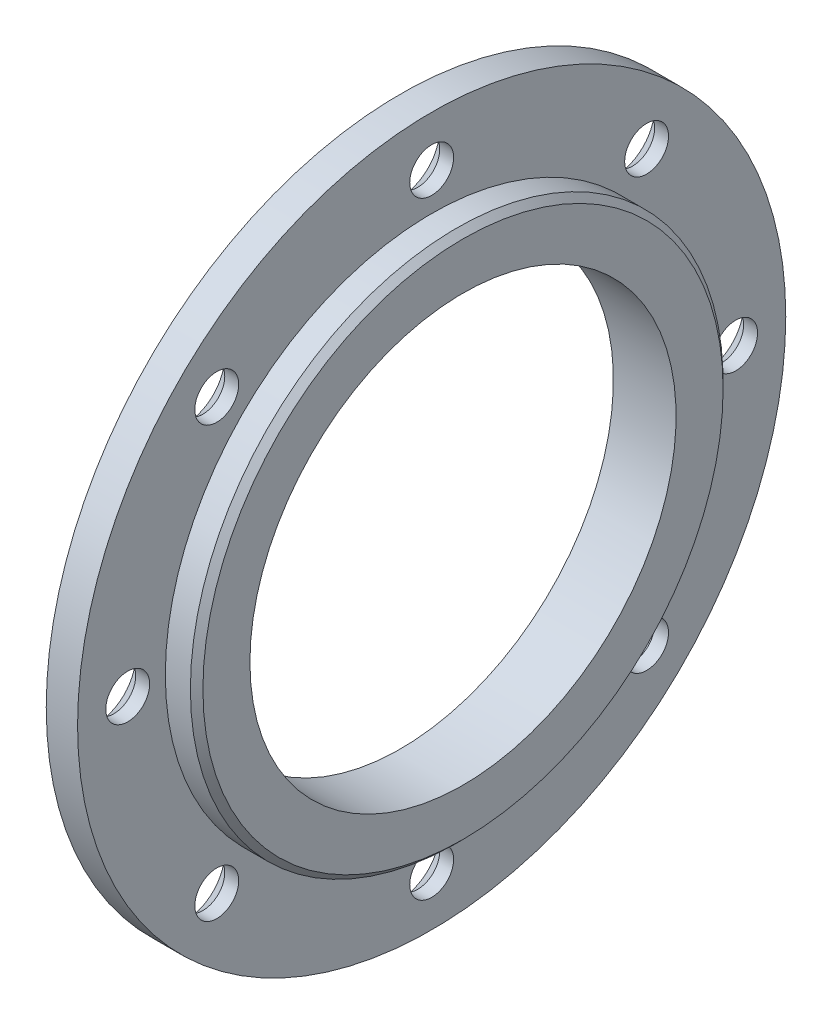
ISO-10303-21;
HEADER;
FILE_DESCRIPTION(('STEP AP214'),'2;1');
FILE_NAME('part.step','',(''),(''),'','','');
FILE_SCHEMA(('AUTOMOTIVE_DESIGN { 1 0 10303 214 1 1 1 1 }'));
ENDSEC;
DATA;
#1=APPLICATION_CONTEXT('core data for automotive mechanical design processes');
#2=APPLICATION_PROTOCOL_DEFINITION('international standard','automotive_design',2000,#1);
#3=PRODUCT_CONTEXT('',#1,'mechanical');
#4=PRODUCT('Part','Part','',(#3));
#5=PRODUCT_RELATED_PRODUCT_CATEGORY('part','',(#4));
#6=PRODUCT_DEFINITION_FORMATION('','',#4);
#7=PRODUCT_DEFINITION_CONTEXT('part definition',#1,'design');
#8=PRODUCT_DEFINITION('design','',#6,#7);
#9=PRODUCT_DEFINITION_SHAPE('','',#8);
#10=(LENGTH_UNIT() NAMED_UNIT(*) SI_UNIT(.MILLI.,.METRE.));
#11=(NAMED_UNIT(*) PLANE_ANGLE_UNIT() SI_UNIT($,.RADIAN.));
#12=(NAMED_UNIT(*) SI_UNIT($,.STERADIAN.) SOLID_ANGLE_UNIT());
#13=UNCERTAINTY_MEASURE_WITH_UNIT(LENGTH_MEASURE(1.E-05),#10,'distance_accuracy_value','');
#14=(GEOMETRIC_REPRESENTATION_CONTEXT(3) GLOBAL_UNCERTAINTY_ASSIGNED_CONTEXT((#13)) GLOBAL_UNIT_ASSIGNED_CONTEXT((#10,
#11,#12)) REPRESENTATION_CONTEXT('',''));
#15=CARTESIAN_POINT('',(0.,0.,0.));
#16=DIRECTION('',(0.,0.,1.));
#17=DIRECTION('',(1.,0.,0.));
#18=AXIS2_PLACEMENT_3D('',#15,#16,#17);
#19=CARTESIAN_POINT('',(0.,34.,0.));
#20=DIRECTION('',(1.,0.,0.));
#21=DIRECTION('',(0.,0.,-1.));
#22=AXIS2_PLACEMENT_3D('',#19,#20,#21);
#23=PLANE('',#22);
#24=CARTESIAN_POINT('',(0.,34.294678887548,-34.2946788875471));
#25=DIRECTION('',(1.,0.,0.));
#26=DIRECTION('',(0.,0.,-1.));
#27=AXIS2_PLACEMENT_3D('',#24,#25,#26);
#28=CIRCLE('',#27,6.28000000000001);
#29=CARTESIAN_POINT('',(0.,34.294678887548,-28.0146788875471));
#30=VERTEX_POINT('',#29);
#31=EDGE_CURVE('E10',#30,#30,#28,.T.);
#32=ORIENTED_EDGE('',*,*,#31,.T.);
#33=EDGE_LOOP('',(#32));
#34=FACE_BOUND('',#33,.T.);
#35=CARTESIAN_POINT('',(0.,5.08010534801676E-13,-48.5));
#36=DIRECTION('',(1.,0.,0.));
#37=DIRECTION('',(0.,0.,-1.));
#38=AXIS2_PLACEMENT_3D('',#35,#36,#37);
#39=CIRCLE('',#38,6.28000000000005);
#40=CARTESIAN_POINT('',(0.,5.08010534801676E-13,-54.7800000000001));
#41=VERTEX_POINT('',#40);
#42=EDGE_CURVE('E39',#41,#41,#39,.T.);
#43=ORIENTED_EDGE('',*,*,#42,.T.);
#44=EDGE_LOOP('',(#43));
#45=FACE_BOUND('',#44,.T.);
#46=CARTESIAN_POINT('',(0.,-34.2946788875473,-34.2946788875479));
#47=DIRECTION('',(1.,0.,0.));
#48=DIRECTION('',(0.,0.,-1.));
#49=AXIS2_PLACEMENT_3D('',#46,#47,#48);
#50=CIRCLE('',#49,6.28000000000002);
#51=CARTESIAN_POINT('',(0.,-34.2946788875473,-28.0146788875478));
#52=VERTEX_POINT('',#51);
#53=EDGE_CURVE('E48',#52,#52,#50,.T.);
#54=ORIENTED_EDGE('',*,*,#53,.T.);
#55=EDGE_LOOP('',(#54));
#56=FACE_BOUND('',#55,.T.);
#57=CARTESIAN_POINT('',(0.,-48.5,-3.38673689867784E-13));
#58=DIRECTION('',(1.,0.,0.));
#59=DIRECTION('',(0.,0.,-1.));
#60=AXIS2_PLACEMENT_3D('',#57,#58,#59);
#61=CIRCLE('',#60,6.28000000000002);
#62=CARTESIAN_POINT('',(0.,-48.5,6.27999999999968));
#63=VERTEX_POINT('',#62);
#64=EDGE_CURVE('E54',#63,#63,#61,.T.);
#65=ORIENTED_EDGE('',*,*,#64,.T.);
#66=EDGE_LOOP('',(#65));
#67=FACE_BOUND('',#66,.T.);
#68=CARTESIAN_POINT('',(0.,-34.2946788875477,34.2946788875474));
#69=DIRECTION('',(1.,0.,0.));
#70=DIRECTION('',(0.,0.,-1.));
#71=AXIS2_PLACEMENT_3D('',#68,#69,#70);
#72=CIRCLE('',#71,6.27999999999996);
#73=CARTESIAN_POINT('',(0.,-34.2946788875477,28.0146788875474));
#74=VERTEX_POINT('',#73);
#75=EDGE_CURVE('E60',#74,#74,#72,.T.);
#76=ORIENTED_EDGE('',*,*,#75,.T.);
#77=EDGE_LOOP('',(#76));
#78=FACE_BOUND('',#77,.T.);
#79=CARTESIAN_POINT('',(0.,-1.69336844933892E-13,48.5));
#80=DIRECTION('',(1.,0.,0.));
#81=DIRECTION('',(0.,0.,-1.));
#82=AXIS2_PLACEMENT_3D('',#79,#80,#81);
#83=CIRCLE('',#82,6.28000000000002);
#84=CARTESIAN_POINT('',(0.,-1.69336844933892E-13,54.78));
#85=VERTEX_POINT('',#84);
#86=EDGE_CURVE('E66',#85,#85,#83,.T.);
#87=ORIENTED_EDGE('',*,*,#86,.T.);
#88=EDGE_LOOP('',(#87));
#89=FACE_BOUND('',#88,.T.);
#90=CARTESIAN_POINT('',(0.,34.2946788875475,34.2946788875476));
#91=DIRECTION('',(1.,0.,0.));
#92=DIRECTION('',(0.,0.,-1.));
#93=AXIS2_PLACEMENT_3D('',#90,#91,#92);
#94=CIRCLE('',#93,6.27999999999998);
#95=CARTESIAN_POINT('',(0.,34.2946788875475,28.0146788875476));
#96=VERTEX_POINT('',#95);
#97=EDGE_CURVE('E72',#96,#96,#94,.T.);
#98=ORIENTED_EDGE('',*,*,#97,.T.);
#99=EDGE_LOOP('',(#98));
#100=FACE_BOUND('',#99,.T.);
#101=CARTESIAN_POINT('',(0.,48.5,0.));
#102=DIRECTION('',(1.,0.,0.));
#103=DIRECTION('',(0.,0.,-1.));
#104=AXIS2_PLACEMENT_3D('',#101,#102,#103);
#105=CIRCLE('',#104,6.28000000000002);
#106=CARTESIAN_POINT('',(0.,48.5,6.28000000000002));
#107=VERTEX_POINT('',#106);
#108=EDGE_CURVE('E78',#107,#107,#105,.T.);
#109=ORIENTED_EDGE('',*,*,#108,.T.);
#110=EDGE_LOOP('',(#109));
#111=FACE_BOUND('',#110,.T.);
#112=CARTESIAN_POINT('',(0.,0.,0.));
#113=DIRECTION('',(-1.,0.,0.));
#114=DIRECTION('',(0.,0.,1.));
#115=AXIS2_PLACEMENT_3D('',#112,#113,#114);
#116=CIRCLE('',#115,34.);
#117=CARTESIAN_POINT('',(0.,0.,34.));
#118=VERTEX_POINT('',#117);
#119=EDGE_CURVE('E109',#118,#118,#116,.T.);
#120=ORIENTED_EDGE('',*,*,#119,.F.);
#121=EDGE_LOOP('',(#120));
#122=FACE_BOUND('',#121,.T.);
#123=CARTESIAN_POINT('',(0.,0.,0.));
#124=DIRECTION('',(-1.,0.,0.));
#125=DIRECTION('',(0.,0.,1.));
#126=AXIS2_PLACEMENT_3D('',#123,#124,#125);
#127=CIRCLE('',#126,56.5);
#128=CARTESIAN_POINT('',(0.,0.,56.5));
#129=VERTEX_POINT('',#128);
#130=EDGE_CURVE('E106',#129,#129,#127,.T.);
#131=ORIENTED_EDGE('',*,*,#130,.T.);
#132=EDGE_LOOP('',(#131));
#133=FACE_BOUND('',#132,.T.);
#134=ADVANCED_FACE('F28',(#34,#45,#56,#67,#78,#89,#100,#111,#122,#133),#23,.F.);
#135=CARTESIAN_POINT('',(-20.4243511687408,0.,0.));
#136=DIRECTION('',(-1.,0.,0.));
#137=DIRECTION('',(0.,0.,1.));
#138=AXIS2_PLACEMENT_3D('',#135,#136,#137);
#139=CYLINDRICAL_SURFACE('',#138,56.5);
#140=ORIENTED_EDGE('',*,*,#130,.F.);
#141=EDGE_LOOP('',(#140));
#142=FACE_BOUND('',#141,.T.);
#143=CARTESIAN_POINT('',(5.,0.,0.));
#144=DIRECTION('',(-1.,0.,0.));
#145=DIRECTION('',(0.,0.,1.));
#146=AXIS2_PLACEMENT_3D('',#143,#144,#145);
#147=CIRCLE('',#146,56.5);
#148=CARTESIAN_POINT('',(5.,0.,56.5));
#149=VERTEX_POINT('',#148);
#150=EDGE_CURVE('E112',#149,#149,#147,.T.);
#151=ORIENTED_EDGE('',*,*,#150,.T.);
#152=EDGE_LOOP('',(#151));
#153=FACE_BOUND('',#152,.T.);
#154=ADVANCED_FACE('F134',(#142,#153),#139,.T.);
#155=CARTESIAN_POINT('',(5.,42.5,0.));
#156=DIRECTION('',(-1.,0.,0.));
#157=DIRECTION('',(0.,0.,1.));
#158=AXIS2_PLACEMENT_3D('',#155,#156,#157);
#159=PLANE('',#158);
#160=CARTESIAN_POINT('',(5.,34.294678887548,-34.2946788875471));
#161=DIRECTION('',(-1.,0.,0.));
#162=DIRECTION('',(0.,0.,1.));
#163=AXIS2_PLACEMENT_3D('',#160,#161,#162);
#164=CIRCLE('',#163,3.5);
#165=CARTESIAN_POINT('',(5.,34.294678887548,-30.7946788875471));
#166=VERTEX_POINT('',#165);
#167=EDGE_CURVE('E79',#166,#166,#164,.T.);
#168=ORIENTED_EDGE('',*,*,#167,.T.);
#169=EDGE_LOOP('',(#168));
#170=FACE_BOUND('',#169,.T.);
#171=CARTESIAN_POINT('',(5.,5.08010534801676E-13,-48.5));
#172=DIRECTION('',(-1.,0.,0.));
#173=DIRECTION('',(0.,0.,1.));
#174=AXIS2_PLACEMENT_3D('',#171,#172,#173);
#175=CIRCLE('',#174,3.5);
#176=CARTESIAN_POINT('',(5.,5.08010534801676E-13,-45.));
#177=VERTEX_POINT('',#176);
#178=EDGE_CURVE('E82',#177,#177,#175,.T.);
#179=ORIENTED_EDGE('',*,*,#178,.T.);
#180=EDGE_LOOP('',(#179));
#181=FACE_BOUND('',#180,.T.);
#182=CARTESIAN_POINT('',(5.,-34.2946788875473,-34.2946788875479));
#183=DIRECTION('',(-1.,0.,0.));
#184=DIRECTION('',(0.,0.,1.));
#185=AXIS2_PLACEMENT_3D('',#182,#183,#184);
#186=CIRCLE('',#185,3.5);
#187=CARTESIAN_POINT('',(5.,-34.2946788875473,-30.7946788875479));
#188=VERTEX_POINT('',#187);
#189=EDGE_CURVE('E85',#188,#188,#186,.T.);
#190=ORIENTED_EDGE('',*,*,#189,.T.);
#191=EDGE_LOOP('',(#190));
#192=FACE_BOUND('',#191,.T.);
#193=CARTESIAN_POINT('',(5.,-48.5,-3.38673689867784E-13));
#194=DIRECTION('',(-1.,0.,0.));
#195=DIRECTION('',(0.,0.,1.));
#196=AXIS2_PLACEMENT_3D('',#193,#194,#195);
#197=CIRCLE('',#196,3.5);
#198=CARTESIAN_POINT('',(5.,-48.5,3.49999999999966));
#199=VERTEX_POINT('',#198);
#200=EDGE_CURVE('E88',#199,#199,#197,.T.);
#201=ORIENTED_EDGE('',*,*,#200,.T.);
#202=EDGE_LOOP('',(#201));
#203=FACE_BOUND('',#202,.T.);
#204=CARTESIAN_POINT('',(5.,-34.2946788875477,34.2946788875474));
#205=DIRECTION('',(-1.,0.,0.));
#206=DIRECTION('',(0.,0.,1.));
#207=AXIS2_PLACEMENT_3D('',#204,#205,#206);
#208=CIRCLE('',#207,3.5);
#209=CARTESIAN_POINT('',(5.,-34.2946788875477,37.7946788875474));
#210=VERTEX_POINT('',#209);
#211=EDGE_CURVE('E91',#210,#210,#208,.T.);
#212=ORIENTED_EDGE('',*,*,#211,.T.);
#213=EDGE_LOOP('',(#212));
#214=FACE_BOUND('',#213,.T.);
#215=CARTESIAN_POINT('',(5.,-1.69336844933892E-13,48.5));
#216=DIRECTION('',(-1.,0.,0.));
#217=DIRECTION('',(0.,0.,1.));
#218=AXIS2_PLACEMENT_3D('',#215,#216,#217);
#219=CIRCLE('',#218,3.5);
#220=CARTESIAN_POINT('',(5.,-1.69336844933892E-13,52.));
#221=VERTEX_POINT('',#220);
#222=EDGE_CURVE('E94',#221,#221,#219,.T.);
#223=ORIENTED_EDGE('',*,*,#222,.T.);
#224=EDGE_LOOP('',(#223));
#225=FACE_BOUND('',#224,.T.);
#226=CARTESIAN_POINT('',(5.,34.2946788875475,34.2946788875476));
#227=DIRECTION('',(-1.,0.,0.));
#228=DIRECTION('',(0.,0.,1.));
#229=AXIS2_PLACEMENT_3D('',#226,#227,#228);
#230=CIRCLE('',#229,3.5);
#231=CARTESIAN_POINT('',(5.,34.2946788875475,37.7946788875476));
#232=VERTEX_POINT('',#231);
#233=EDGE_CURVE('E97',#232,#232,#230,.T.);
#234=ORIENTED_EDGE('',*,*,#233,.T.);
#235=EDGE_LOOP('',(#234));
#236=FACE_BOUND('',#235,.T.);
#237=CARTESIAN_POINT('',(5.,48.5,0.));
#238=DIRECTION('',(-1.,0.,0.));
#239=DIRECTION('',(0.,0.,1.));
#240=AXIS2_PLACEMENT_3D('',#237,#238,#239);
#241=CIRCLE('',#240,3.5);
#242=CARTESIAN_POINT('',(5.,48.5,3.5));
#243=VERTEX_POINT('',#242);
#244=EDGE_CURVE('E100',#243,#243,#241,.T.);
#245=ORIENTED_EDGE('',*,*,#244,.T.);
#246=EDGE_LOOP('',(#245));
#247=FACE_BOUND('',#246,.T.);
#248=ORIENTED_EDGE('',*,*,#150,.F.);
#249=EDGE_LOOP('',(#248));
#250=FACE_BOUND('',#249,.T.);
#251=CARTESIAN_POINT('',(5.,0.,0.));
#252=DIRECTION('',(-1.,0.,0.));
#253=DIRECTION('',(0.,0.,1.));
#254=AXIS2_PLACEMENT_3D('',#251,#252,#253);
#255=CIRCLE('',#254,42.5);
#256=CARTESIAN_POINT('',(5.,0.,42.5));
#257=VERTEX_POINT('',#256);
#258=EDGE_CURVE('E115',#257,#257,#255,.T.);
#259=ORIENTED_EDGE('',*,*,#258,.T.);
#260=EDGE_LOOP('',(#259));
#261=FACE_BOUND('',#260,.T.);
#262=ADVANCED_FACE('F140',(#170,#181,#192,#203,#214,#225,#236,#247,#250,#261),#159,.F.);
#263=CARTESIAN_POINT('',(-20.4243511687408,0.,0.));
#264=DIRECTION('',(-1.,0.,0.));
#265=DIRECTION('',(0.,0.,1.));
#266=AXIS2_PLACEMENT_3D('',#263,#264,#265);
#267=CYLINDRICAL_SURFACE('',#266,42.5);
#268=ORIENTED_EDGE('',*,*,#258,.F.);
#269=EDGE_LOOP('',(#268));
#270=FACE_BOUND('',#269,.T.);
#271=CARTESIAN_POINT('',(9.,0.,0.));
#272=DIRECTION('',(-1.,0.,0.));
#273=DIRECTION('',(0.,0.,1.));
#274=AXIS2_PLACEMENT_3D('',#271,#272,#273);
#275=CIRCLE('',#274,42.5);
#276=CARTESIAN_POINT('',(9.,0.,42.5));
#277=VERTEX_POINT('',#276);
#278=EDGE_CURVE('E118',#277,#277,#275,.T.);
#279=ORIENTED_EDGE('',*,*,#278,.T.);
#280=EDGE_LOOP('',(#279));
#281=FACE_BOUND('',#280,.T.);
#282=ADVANCED_FACE('F146',(#270,#281),#267,.T.);
#283=CARTESIAN_POINT('',(10.,0.,0.));
#284=DIRECTION('',(-1.,0.,0.));
#285=DIRECTION('',(0.,0.,1.));
#286=AXIS2_PLACEMENT_3D('',#283,#284,#285);
#287=CONICAL_SURFACE('',#286,41.5,0.785398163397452);
#288=ORIENTED_EDGE('',*,*,#278,.F.);
#289=EDGE_LOOP('',(#288));
#290=FACE_BOUND('',#289,.T.);
#291=CARTESIAN_POINT('',(10.,0.,0.));
#292=DIRECTION('',(-1.,0.,0.));
#293=DIRECTION('',(0.,0.,1.));
#294=AXIS2_PLACEMENT_3D('',#291,#292,#293);
#295=CIRCLE('',#294,41.5);
#296=CARTESIAN_POINT('',(10.,0.,41.5));
#297=VERTEX_POINT('',#296);
#298=EDGE_CURVE('E121',#297,#297,#295,.T.);
#299=ORIENTED_EDGE('',*,*,#298,.T.);
#300=EDGE_LOOP('',(#299));
#301=FACE_BOUND('',#300,.T.);
#302=ADVANCED_FACE('F153',(#290,#301),#287,.T.);
#303=CARTESIAN_POINT('',(10.,41.5,0.));
#304=DIRECTION('',(-1.,0.,0.));
#305=DIRECTION('',(0.,0.,1.));
#306=AXIS2_PLACEMENT_3D('',#303,#304,#305);
#307=PLANE('',#306);
#308=ORIENTED_EDGE('',*,*,#298,.F.);
#309=EDGE_LOOP('',(#308));
#310=FACE_BOUND('',#309,.T.);
#311=CARTESIAN_POINT('',(10.,0.,0.));
#312=DIRECTION('',(-1.,0.,0.));
#313=DIRECTION('',(0.,0.,1.));
#314=AXIS2_PLACEMENT_3D('',#311,#312,#313);
#315=CIRCLE('',#314,34.);
#316=CARTESIAN_POINT('',(10.,0.,34.));
#317=VERTEX_POINT('',#316);
#318=EDGE_CURVE('E124',#317,#317,#315,.T.);
#319=ORIENTED_EDGE('',*,*,#318,.T.);
#320=EDGE_LOOP('',(#319));
#321=FACE_BOUND('',#320,.T.);
#322=ADVANCED_FACE('F159',(#310,#321),#307,.F.);
#323=CARTESIAN_POINT('',(-20.4243511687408,0.,0.));
#324=DIRECTION('',(-1.,0.,0.));
#325=DIRECTION('',(0.,0.,1.));
#326=AXIS2_PLACEMENT_3D('',#323,#324,#325);
#327=CYLINDRICAL_SURFACE('',#326,34.);
#328=ORIENTED_EDGE('',*,*,#318,.F.);
#329=EDGE_LOOP('',(#328));
#330=FACE_BOUND('',#329,.T.);
#331=ORIENTED_EDGE('',*,*,#119,.T.);
#332=EDGE_LOOP('',(#331));
#333=FACE_BOUND('',#332,.T.);
#334=ADVANCED_FACE('F130',(#330,#333),#327,.F.);
#335=CARTESIAN_POINT('',(9.,48.5,0.));
#336=DIRECTION('',(-1.,0.,0.));
#337=DIRECTION('',(0.,0.,1.));
#338=AXIS2_PLACEMENT_3D('',#335,#336,#337);
#339=CYLINDRICAL_SURFACE('',#338,3.5);
#340=CARTESIAN_POINT('',(2.78000000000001,48.5,0.));
#341=DIRECTION('',(1.,0.,0.));
#342=DIRECTION('',(0.,0.,-1.));
#343=AXIS2_PLACEMENT_3D('',#340,#341,#342);
#344=CIRCLE('',#343,3.5);
#345=CARTESIAN_POINT('',(2.78000000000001,48.5,3.5));
#346=VERTEX_POINT('',#345);
#347=EDGE_CURVE('E103',#346,#346,#344,.F.);
#348=ORIENTED_EDGE('',*,*,#347,.T.);
#349=EDGE_LOOP('',(#348));
#350=FACE_BOUND('',#349,.T.);
#351=ORIENTED_EDGE('',*,*,#244,.F.);
#352=EDGE_LOOP('',(#351));
#353=FACE_BOUND('',#352,.T.);
#354=ADVANCED_FACE('F169',(#350,#353),#339,.F.);
#355=CARTESIAN_POINT('',(2.78000000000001,48.5,0.));
#356=DIRECTION('',(-1.,0.,0.));
#357=DIRECTION('',(0.,0.,1.));
#358=AXIS2_PLACEMENT_3D('',#355,#356,#357);
#359=CONICAL_SURFACE('',#358,3.5,0.785398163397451);
#360=CARTESIAN_POINT('',(0.,48.5,6.28000000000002));
#361=CARTESIAN_POINT('',(0.0289583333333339,48.5,6.25104166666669));
#362=CARTESIAN_POINT('',(0.0579166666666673,48.5,6.22208333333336));
#363=CARTESIAN_POINT('',(0.115833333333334,48.5,6.16416666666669));
#364=CARTESIAN_POINT('',(0.144791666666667,48.5,6.13520833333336));
#365=CARTESIAN_POINT('',(0.202708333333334,48.5,6.07729166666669));
#366=CARTESIAN_POINT('',(0.231666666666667,48.5,6.04833333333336));
#367=CARTESIAN_POINT('',(0.289583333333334,48.5,5.99041666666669));
#368=CARTESIAN_POINT('',(0.318541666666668,48.5,5.96145833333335));
#369=CARTESIAN_POINT('',(0.376458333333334,48.5,5.90354166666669));
#370=CARTESIAN_POINT('',(0.405416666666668,48.5,5.87458333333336));
#371=CARTESIAN_POINT('',(0.463333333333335,48.5,5.81666666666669));
#372=CARTESIAN_POINT('',(0.492291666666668,48.5,5.78770833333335));
#373=CARTESIAN_POINT('',(0.550208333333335,48.5,5.72979166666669));
#374=CARTESIAN_POINT('',(0.579166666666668,48.5,5.70083333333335));
#375=CARTESIAN_POINT('',(0.637083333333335,48.5,5.64291666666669));
#376=CARTESIAN_POINT('',(0.666041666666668,48.5,5.61395833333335));
#377=CARTESIAN_POINT('',(0.723958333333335,48.5,5.55604166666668));
#378=CARTESIAN_POINT('',(0.752916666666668,48.5,5.52708333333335));
#379=CARTESIAN_POINT('',(0.810833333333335,48.5,5.46916666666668));
#380=CARTESIAN_POINT('',(0.839791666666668,48.5,5.44020833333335));
#381=CARTESIAN_POINT('',(0.897708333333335,48.5,5.38229166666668));
#382=CARTESIAN_POINT('',(0.926666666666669,48.5,5.35333333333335));
#383=CARTESIAN_POINT('',(0.984583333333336,48.5,5.29541666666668));
#384=CARTESIAN_POINT('',(1.01354166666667,48.5,5.26645833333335));
#385=CARTESIAN_POINT('',(1.07145833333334,48.5,5.20854166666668));
#386=CARTESIAN_POINT('',(1.10041666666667,48.5,5.17958333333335));
#387=CARTESIAN_POINT('',(1.15833333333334,48.5,5.12166666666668));
#388=CARTESIAN_POINT('',(1.18729166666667,48.5,5.09270833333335));
#389=CARTESIAN_POINT('',(1.24520833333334,48.5,5.03479166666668));
#390=CARTESIAN_POINT('',(1.27416666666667,48.5,5.00583333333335));
#391=CARTESIAN_POINT('',(1.33208333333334,48.5,4.94791666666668));
#392=CARTESIAN_POINT('',(1.36104166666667,48.5,4.91895833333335));
#393=CARTESIAN_POINT('',(1.41895833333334,48.5,4.86104166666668));
#394=CARTESIAN_POINT('',(1.44791666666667,48.5,4.83208333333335));
#395=CARTESIAN_POINT('',(1.50583333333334,48.5,4.77416666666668));
#396=CARTESIAN_POINT('',(1.53479166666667,48.5,4.74520833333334));
#397=CARTESIAN_POINT('',(1.59270833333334,48.5,4.68729166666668));
#398=CARTESIAN_POINT('',(1.62166666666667,48.5,4.65833333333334));
#399=CARTESIAN_POINT('',(1.67958333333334,48.5,4.60041666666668));
#400=CARTESIAN_POINT('',(1.70854166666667,48.5,4.57145833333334));
#401=CARTESIAN_POINT('',(1.76645833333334,48.5,4.51354166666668));
#402=CARTESIAN_POINT('',(1.79541666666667,48.5,4.48458333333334));
#403=CARTESIAN_POINT('',(1.85333333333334,48.5,4.42666666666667));
#404=CARTESIAN_POINT('',(1.88229166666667,48.5,4.39770833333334));
#405=CARTESIAN_POINT('',(1.94020833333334,48.5,4.33979166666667));
#406=CARTESIAN_POINT('',(1.96916666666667,48.5,4.31083333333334));
#407=CARTESIAN_POINT('',(2.02708333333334,48.5,4.25291666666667));
#408=CARTESIAN_POINT('',(2.05604166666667,48.5,4.22395833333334));
#409=CARTESIAN_POINT('',(2.11395833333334,48.5,4.16604166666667));
#410=CARTESIAN_POINT('',(2.14291666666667,48.5,4.13708333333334));
#411=CARTESIAN_POINT('',(2.20083333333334,48.5,4.07916666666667));
#412=CARTESIAN_POINT('',(2.22979166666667,48.5,4.05020833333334));
#413=CARTESIAN_POINT('',(2.28770833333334,48.5,3.99229166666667));
#414=CARTESIAN_POINT('',(2.31666666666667,48.5,3.96333333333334));
#415=CARTESIAN_POINT('',(2.37458333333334,48.5,3.90541666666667));
#416=CARTESIAN_POINT('',(2.40354166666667,48.5,3.87645833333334));
#417=CARTESIAN_POINT('',(2.46145833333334,48.5,3.81854166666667));
#418=CARTESIAN_POINT('',(2.49041666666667,48.5,3.78958333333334));
#419=CARTESIAN_POINT('',(2.54833333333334,48.5,3.73166666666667));
#420=CARTESIAN_POINT('',(2.57729166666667,48.5,3.70270833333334));
#421=CARTESIAN_POINT('',(2.63520833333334,48.5,3.64479166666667));
#422=CARTESIAN_POINT('',(2.66416666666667,48.5,3.61583333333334));
#423=CARTESIAN_POINT('',(2.72208333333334,48.5,3.55791666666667));
#424=CARTESIAN_POINT('',(2.75104166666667,48.5,3.52895833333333));
#425=CARTESIAN_POINT('',(2.78000000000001,48.5,3.5));
#426=B_SPLINE_CURVE_WITH_KNOTS('',3,(#360,#361,#362,#363,#364,#365,#366,#367,#368,#369,#370,
#371,#372,#373,#374,#375,#376,#377,#378,#379,#380,#381,#382,#383,#384,#385,#386,#387,#388,#389,
#390,#391,#392,#393,#394,#395,#396,#397,#398,#399,#400,#401,#402,#403,#404,#405,#406,#407,#408,
#409,#410,#411,#412,#413,#414,#415,#416,#417,#418,#419,#420,#421,#422,#423,#424,#425),
.UNSPECIFIED.,.F.,.F.,(4,2,2,2,2,2,2,2,2,2,2,2,2,2,2,2,2,2,2,2,2,2,2,2,2,2,2,2,2,2,2,2,4),(0.,
0.122859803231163,0.245719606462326,0.36857940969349,0.491439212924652,0.614299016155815,
0.737158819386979,0.860018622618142,0.982878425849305,1.10573822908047,1.22859803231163,
1.3514578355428,1.47431763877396,1.59717744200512,1.72003724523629,1.84289704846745,
1.96575685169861,2.08861665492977,2.21147645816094,2.3343362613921,2.45719606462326,
2.58005586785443,2.70291567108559,2.82577547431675,2.94863527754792,3.07149508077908,
3.19435488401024,3.31721468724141,3.44007449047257,3.56293429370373,3.6857940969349,
3.80865390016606,3.93151370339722),.UNSPECIFIED.);
#427=EDGE_CURVE('BSEAM174',#107,#346,#426,.T.);
#428=ORIENTED_EDGE('',*,*,#108,.F.);
#429=ORIENTED_EDGE('',*,*,#347,.F.);
#430=ORIENTED_EDGE('',*,*,#427,.T.);
#431=ORIENTED_EDGE('',*,*,#427,.F.);
#432=EDGE_LOOP('',(#428,#430,#429,#431));
#433=FACE_BOUND('',#432,.T.);
#434=ADVANCED_FACE('F174',(#433),#359,.F.);
#435=CARTESIAN_POINT('',(9.,34.2946788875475,34.2946788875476));
#436=DIRECTION('',(-1.,0.,0.));
#437=DIRECTION('',(0.,0.,1.));
#438=AXIS2_PLACEMENT_3D('',#435,#436,#437);
#439=CYLINDRICAL_SURFACE('',#438,3.5);
#440=CARTESIAN_POINT('',(2.77999999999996,34.2946788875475,34.2946788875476));
#441=DIRECTION('',(1.,0.,0.));
#442=DIRECTION('',(0.,0.,-1.));
#443=AXIS2_PLACEMENT_3D('',#440,#441,#442);
#444=CIRCLE('',#443,3.5);
#445=CARTESIAN_POINT('',(2.77999999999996,34.2946788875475,30.7946788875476));
#446=VERTEX_POINT('',#445);
#447=EDGE_CURVE('E75',#446,#446,#444,.F.);
#448=ORIENTED_EDGE('',*,*,#447,.T.);
#449=EDGE_LOOP('',(#448));
#450=FACE_BOUND('',#449,.T.);
#451=ORIENTED_EDGE('',*,*,#233,.F.);
#452=EDGE_LOOP('',(#451));
#453=FACE_BOUND('',#452,.T.);
#454=ADVANCED_FACE('F181',(#450,#453),#439,.F.);
#455=CARTESIAN_POINT('',(9.,-1.69336844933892E-13,48.5));
#456=DIRECTION('',(-1.,0.,0.));
#457=DIRECTION('',(0.,0.,1.));
#458=AXIS2_PLACEMENT_3D('',#455,#456,#457);
#459=CYLINDRICAL_SURFACE('',#458,3.5);
#460=CARTESIAN_POINT('',(2.78000000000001,-1.69336844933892E-13,48.5));
#461=DIRECTION('',(1.,0.,0.));
#462=DIRECTION('',(0.,0.,-1.));
#463=AXIS2_PLACEMENT_3D('',#460,#461,#462);
#464=CIRCLE('',#463,3.5);
#465=CARTESIAN_POINT('',(2.78000000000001,-1.69336844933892E-13,52.));
#466=VERTEX_POINT('',#465);
#467=EDGE_CURVE('E69',#466,#466,#464,.F.);
#468=ORIENTED_EDGE('',*,*,#467,.T.);
#469=EDGE_LOOP('',(#468));
#470=FACE_BOUND('',#469,.T.);
#471=ORIENTED_EDGE('',*,*,#222,.F.);
#472=EDGE_LOOP('',(#471));
#473=FACE_BOUND('',#472,.T.);
#474=ADVANCED_FACE('F236',(#470,#473),#459,.F.);
#475=CARTESIAN_POINT('',(9.,-34.2946788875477,34.2946788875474));
#476=DIRECTION('',(-1.,0.,0.));
#477=DIRECTION('',(0.,0.,1.));
#478=AXIS2_PLACEMENT_3D('',#475,#476,#477);
#479=CYLINDRICAL_SURFACE('',#478,3.5);
#480=CARTESIAN_POINT('',(2.77999999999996,-34.2946788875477,34.2946788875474));
#481=DIRECTION('',(1.,0.,0.));
#482=DIRECTION('',(0.,0.,-1.));
#483=AXIS2_PLACEMENT_3D('',#480,#481,#482);
#484=CIRCLE('',#483,3.5);
#485=CARTESIAN_POINT('',(2.77999999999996,-34.2946788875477,30.7946788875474));
#486=VERTEX_POINT('',#485);
#487=EDGE_CURVE('E63',#486,#486,#484,.F.);
#488=ORIENTED_EDGE('',*,*,#487,.T.);
#489=EDGE_LOOP('',(#488));
#490=FACE_BOUND('',#489,.T.);
#491=ORIENTED_EDGE('',*,*,#211,.F.);
#492=EDGE_LOOP('',(#491));
#493=FACE_BOUND('',#492,.T.);
#494=ADVANCED_FACE('F241',(#490,#493),#479,.F.);
#495=CARTESIAN_POINT('',(9.,-48.5,-3.38673689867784E-13));
#496=DIRECTION('',(-1.,0.,0.));
#497=DIRECTION('',(0.,0.,1.));
#498=AXIS2_PLACEMENT_3D('',#495,#496,#497);
#499=CYLINDRICAL_SURFACE('',#498,3.5);
#500=CARTESIAN_POINT('',(2.78000000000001,-48.5,-3.38673689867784E-13));
#501=DIRECTION('',(1.,0.,0.));
#502=DIRECTION('',(0.,0.,-1.));
#503=AXIS2_PLACEMENT_3D('',#500,#501,#502);
#504=CIRCLE('',#503,3.5);
#505=CARTESIAN_POINT('',(2.78000000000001,-48.5,3.49999999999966));
#506=VERTEX_POINT('',#505);
#507=EDGE_CURVE('E57',#506,#506,#504,.F.);
#508=ORIENTED_EDGE('',*,*,#507,.T.);
#509=EDGE_LOOP('',(#508));
#510=FACE_BOUND('',#509,.T.);
#511=ORIENTED_EDGE('',*,*,#200,.F.);
#512=EDGE_LOOP('',(#511));
#513=FACE_BOUND('',#512,.T.);
#514=ADVANCED_FACE('F247',(#510,#513),#499,.F.);
#515=CARTESIAN_POINT('',(9.,-34.2946788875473,-34.2946788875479));
#516=DIRECTION('',(-1.,0.,0.));
#517=DIRECTION('',(0.,0.,1.));
#518=AXIS2_PLACEMENT_3D('',#515,#516,#517);
#519=CYLINDRICAL_SURFACE('',#518,3.5);
#520=CARTESIAN_POINT('',(2.78000000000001,-34.2946788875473,-34.2946788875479));
#521=DIRECTION('',(1.,0.,0.));
#522=DIRECTION('',(0.,0.,-1.));
#523=AXIS2_PLACEMENT_3D('',#520,#521,#522);
#524=CIRCLE('',#523,3.5);
#525=CARTESIAN_POINT('',(2.78000000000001,-34.2946788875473,-30.7946788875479));
#526=VERTEX_POINT('',#525);
#527=EDGE_CURVE('E51',#526,#526,#524,.F.);
#528=ORIENTED_EDGE('',*,*,#527,.T.);
#529=EDGE_LOOP('',(#528));
#530=FACE_BOUND('',#529,.T.);
#531=ORIENTED_EDGE('',*,*,#189,.F.);
#532=EDGE_LOOP('',(#531));
#533=FACE_BOUND('',#532,.T.);
#534=ADVANCED_FACE('F217',(#530,#533),#519,.F.);
#535=CARTESIAN_POINT('',(9.,5.08010534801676E-13,-48.5));
#536=DIRECTION('',(-1.,0.,0.));
#537=DIRECTION('',(0.,0.,1.));
#538=AXIS2_PLACEMENT_3D('',#535,#536,#537);
#539=CYLINDRICAL_SURFACE('',#538,3.5);
#540=CARTESIAN_POINT('',(2.78000000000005,5.08010534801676E-13,-48.5));
#541=DIRECTION('',(1.,0.,0.));
#542=DIRECTION('',(0.,0.,-1.));
#543=AXIS2_PLACEMENT_3D('',#540,#541,#542);
#544=CIRCLE('',#543,3.5);
#545=CARTESIAN_POINT('',(2.78000000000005,5.08010534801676E-13,-52.));
#546=VERTEX_POINT('',#545);
#547=EDGE_CURVE('E43',#546,#546,#544,.F.);
#548=ORIENTED_EDGE('',*,*,#547,.T.);
#549=EDGE_LOOP('',(#548));
#550=FACE_BOUND('',#549,.T.);
#551=ORIENTED_EDGE('',*,*,#178,.F.);
#552=EDGE_LOOP('',(#551));
#553=FACE_BOUND('',#552,.T.);
#554=ADVANCED_FACE('F214',(#550,#553),#539,.F.);
#555=CARTESIAN_POINT('',(9.,34.294678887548,-34.2946788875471));
#556=DIRECTION('',(-1.,0.,0.));
#557=DIRECTION('',(0.,0.,1.));
#558=AXIS2_PLACEMENT_3D('',#555,#556,#557);
#559=CYLINDRICAL_SURFACE('',#558,3.5);
#560=CARTESIAN_POINT('',(2.78,34.294678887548,-34.2946788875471));
#561=DIRECTION('',(1.,0.,0.));
#562=DIRECTION('',(0.,0.,-1.));
#563=AXIS2_PLACEMENT_3D('',#560,#561,#562);
#564=CIRCLE('',#563,3.5);
#565=CARTESIAN_POINT('',(2.78,34.294678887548,-30.7946788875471));
#566=VERTEX_POINT('',#565);
#567=EDGE_CURVE('E35',#566,#566,#564,.F.);
#568=ORIENTED_EDGE('',*,*,#567,.T.);
#569=EDGE_LOOP('',(#568));
#570=FACE_BOUND('',#569,.T.);
#571=ORIENTED_EDGE('',*,*,#167,.F.);
#572=EDGE_LOOP('',(#571));
#573=FACE_BOUND('',#572,.T.);
#574=ADVANCED_FACE('F187',(#570,#573),#559,.F.);
#575=CARTESIAN_POINT('',(2.77999999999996,34.2946788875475,34.2946788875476));
#576=DIRECTION('',(-1.,0.,0.));
#577=DIRECTION('',(0.,0.,1.));
#578=AXIS2_PLACEMENT_3D('',#575,#576,#577);
#579=CONICAL_SURFACE('',#578,3.5,0.785398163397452);
#580=ORIENTED_EDGE('',*,*,#97,.F.);
#581=EDGE_LOOP('',(#580));
#582=FACE_BOUND('',#581,.T.);
#583=ORIENTED_EDGE('',*,*,#447,.F.);
#584=EDGE_LOOP('',(#583));
#585=FACE_BOUND('',#584,.T.);
#586=ADVANCED_FACE('F183',(#582,#585),#579,.F.);
#587=CARTESIAN_POINT('',(2.78000000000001,-1.69336844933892E-13,48.5));
#588=DIRECTION('',(-1.,0.,0.));
#589=DIRECTION('',(0.,0.,1.));
#590=AXIS2_PLACEMENT_3D('',#587,#588,#589);
#591=CONICAL_SURFACE('',#590,3.5,0.785398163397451);
#592=CARTESIAN_POINT('',(0.,-1.69336844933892E-13,54.78));
#593=CARTESIAN_POINT('',(0.0289583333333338,-1.69336844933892E-13,54.7510416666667));
#594=CARTESIAN_POINT('',(0.0579166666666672,-1.69336844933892E-13,54.7220833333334));
#595=CARTESIAN_POINT('',(0.115833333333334,-1.69336844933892E-13,54.6641666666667));
#596=CARTESIAN_POINT('',(0.144791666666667,-1.69336844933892E-13,54.6352083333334));
#597=CARTESIAN_POINT('',(0.202708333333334,-1.69336844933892E-13,54.5772916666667));
#598=CARTESIAN_POINT('',(0.231666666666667,-1.69336844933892E-13,54.5483333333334));
#599=CARTESIAN_POINT('',(0.289583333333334,-1.69336844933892E-13,54.4904166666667));
#600=CARTESIAN_POINT('',(0.318541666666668,-1.69336844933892E-13,54.4614583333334));
#601=CARTESIAN_POINT('',(0.376458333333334,-1.69336844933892E-13,54.4035416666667));
#602=CARTESIAN_POINT('',(0.405416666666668,-1.69336844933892E-13,54.3745833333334));
#603=CARTESIAN_POINT('',(0.463333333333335,-1.69336844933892E-13,54.3166666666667));
#604=CARTESIAN_POINT('',(0.492291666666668,-1.69336844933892E-13,54.2877083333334));
#605=CARTESIAN_POINT('',(0.550208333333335,-1.69336844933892E-13,54.2297916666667));
#606=CARTESIAN_POINT('',(0.579166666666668,-1.69336844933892E-13,54.2008333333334));
#607=CARTESIAN_POINT('',(0.637083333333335,-1.69336844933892E-13,54.1429166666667));
#608=CARTESIAN_POINT('',(0.666041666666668,-1.69336844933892E-13,54.1139583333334));
#609=CARTESIAN_POINT('',(0.723958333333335,-1.69336844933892E-13,54.0560416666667));
#610=CARTESIAN_POINT('',(0.752916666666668,-1.69336844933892E-13,54.0270833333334));
#611=CARTESIAN_POINT('',(0.810833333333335,-1.69336844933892E-13,53.9691666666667));
#612=CARTESIAN_POINT('',(0.839791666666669,-1.69336844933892E-13,53.9402083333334));
#613=CARTESIAN_POINT('',(0.897708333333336,-1.69336844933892E-13,53.8822916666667));
#614=CARTESIAN_POINT('',(0.926666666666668,-1.69336844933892E-13,53.8533333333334));
#615=CARTESIAN_POINT('',(0.984583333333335,-1.69336844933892E-13,53.7954166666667));
#616=CARTESIAN_POINT('',(1.01354166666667,-1.69336844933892E-13,53.7664583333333));
#617=CARTESIAN_POINT('',(1.07145833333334,-1.69336844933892E-13,53.7085416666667));
#618=CARTESIAN_POINT('',(1.10041666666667,-1.69336844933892E-13,53.6795833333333));
#619=CARTESIAN_POINT('',(1.15833333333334,-1.69336844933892E-13,53.6216666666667));
#620=CARTESIAN_POINT('',(1.18729166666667,-1.69336844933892E-13,53.5927083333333));
#621=CARTESIAN_POINT('',(1.24520833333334,-1.69336844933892E-13,53.5347916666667));
#622=CARTESIAN_POINT('',(1.27416666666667,-1.69336844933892E-13,53.5058333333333));
#623=CARTESIAN_POINT('',(1.33208333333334,-1.69336844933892E-13,53.4479166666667));
#624=CARTESIAN_POINT('',(1.36104166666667,-1.69336844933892E-13,53.4189583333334));
#625=CARTESIAN_POINT('',(1.41895833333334,-1.69336844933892E-13,53.3610416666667));
#626=CARTESIAN_POINT('',(1.44791666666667,-1.69336844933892E-13,53.3320833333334));
#627=CARTESIAN_POINT('',(1.50583333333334,-1.69336844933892E-13,53.2741666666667));
#628=CARTESIAN_POINT('',(1.53479166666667,-1.69336844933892E-13,53.2452083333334));
#629=CARTESIAN_POINT('',(1.59270833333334,-1.69336844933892E-13,53.1872916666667));
#630=CARTESIAN_POINT('',(1.62166666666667,-1.69336844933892E-13,53.1583333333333));
#631=CARTESIAN_POINT('',(1.67958333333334,-1.69336844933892E-13,53.1004166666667));
#632=CARTESIAN_POINT('',(1.70854166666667,-1.69336844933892E-13,53.0714583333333));
#633=CARTESIAN_POINT('',(1.76645833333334,-1.69336844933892E-13,53.0135416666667));
#634=CARTESIAN_POINT('',(1.79541666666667,-1.69336844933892E-13,52.9845833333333));
#635=CARTESIAN_POINT('',(1.85333333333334,-1.69336844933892E-13,52.9266666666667));
#636=CARTESIAN_POINT('',(1.88229166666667,-1.69336844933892E-13,52.8977083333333));
#637=CARTESIAN_POINT('',(1.94020833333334,-1.69336844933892E-13,52.8397916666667));
#638=CARTESIAN_POINT('',(1.96916666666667,-1.69336844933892E-13,52.8108333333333));
#639=CARTESIAN_POINT('',(2.02708333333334,-1.69336844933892E-13,52.7529166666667));
#640=CARTESIAN_POINT('',(2.05604166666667,-1.69336844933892E-13,52.7239583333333));
#641=CARTESIAN_POINT('',(2.11395833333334,-1.69336844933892E-13,52.6660416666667));
#642=CARTESIAN_POINT('',(2.14291666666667,-1.69336844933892E-13,52.6370833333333));
#643=CARTESIAN_POINT('',(2.20083333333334,-1.69336844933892E-13,52.5791666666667));
#644=CARTESIAN_POINT('',(2.22979166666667,-1.69336844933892E-13,52.5502083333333));
#645=CARTESIAN_POINT('',(2.28770833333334,-1.69336844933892E-13,52.4922916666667));
#646=CARTESIAN_POINT('',(2.31666666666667,-1.69336844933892E-13,52.4633333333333));
#647=CARTESIAN_POINT('',(2.37458333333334,-1.69336844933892E-13,52.4054166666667));
#648=CARTESIAN_POINT('',(2.40354166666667,-1.69336844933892E-13,52.3764583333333));
#649=CARTESIAN_POINT('',(2.46145833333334,-1.69336844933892E-13,52.3185416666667));
#650=CARTESIAN_POINT('',(2.49041666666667,-1.69336844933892E-13,52.2895833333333));
#651=CARTESIAN_POINT('',(2.54833333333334,-1.69336844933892E-13,52.2316666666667));
#652=CARTESIAN_POINT('',(2.57729166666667,-1.69336844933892E-13,52.2027083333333));
#653=CARTESIAN_POINT('',(2.63520833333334,-1.69336844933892E-13,52.1447916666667));
#654=CARTESIAN_POINT('',(2.66416666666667,-1.69336844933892E-13,52.1158333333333));
#655=CARTESIAN_POINT('',(2.72208333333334,-1.69336844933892E-13,52.0579166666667));
#656=CARTESIAN_POINT('',(2.75104166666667,-1.69336844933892E-13,52.0289583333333));
#657=CARTESIAN_POINT('',(2.78000000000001,-1.69336844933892E-13,52.));
#658=B_SPLINE_CURVE_WITH_KNOTS('',3,(#592,#593,#594,#595,#596,#597,#598,#599,#600,#601,#602,
#603,#604,#605,#606,#607,#608,#609,#610,#611,#612,#613,#614,#615,#616,#617,#618,#619,#620,#621,
#622,#623,#624,#625,#626,#627,#628,#629,#630,#631,#632,#633,#634,#635,#636,#637,#638,#639,#640,
#641,#642,#643,#644,#645,#646,#647,#648,#649,#650,#651,#652,#653,#654,#655,#656,#657),
.UNSPECIFIED.,.F.,.F.,(4,2,2,2,2,2,2,2,2,2,2,2,2,2,2,2,2,2,2,2,2,2,2,2,2,2,2,2,2,2,2,2,4),(0.,
0.122859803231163,0.245719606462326,0.368579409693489,0.491439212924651,0.614299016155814,
0.737158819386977,0.86001862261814,0.982878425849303,1.10573822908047,1.22859803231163,
1.3514578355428,1.47431763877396,1.59717744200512,1.72003724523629,1.84289704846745,
1.96575685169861,2.08861665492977,2.21147645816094,2.3343362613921,2.45719606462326,
2.58005586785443,2.70291567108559,2.82577547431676,2.94863527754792,3.07149508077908,
3.19435488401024,3.31721468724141,3.44007449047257,3.56293429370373,3.6857940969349,
3.80865390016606,3.93151370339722),.UNSPECIFIED.);
#659=EDGE_CURVE('BSEAM186',#85,#466,#658,.T.);
#660=ORIENTED_EDGE('',*,*,#86,.F.);
#661=ORIENTED_EDGE('',*,*,#467,.F.);
#662=ORIENTED_EDGE('',*,*,#659,.T.);
#663=ORIENTED_EDGE('',*,*,#659,.F.);
#664=EDGE_LOOP('',(#660,#662,#661,#663));
#665=FACE_BOUND('',#664,.T.);
#666=ADVANCED_FACE('F186',(#665),#591,.F.);
#667=CARTESIAN_POINT('',(2.77999999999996,-34.2946788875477,34.2946788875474));
#668=DIRECTION('',(-1.,0.,0.));
#669=DIRECTION('',(0.,0.,1.));
#670=AXIS2_PLACEMENT_3D('',#667,#668,#669);
#671=CONICAL_SURFACE('',#670,3.5,0.785398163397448);
#672=ORIENTED_EDGE('',*,*,#75,.F.);
#673=EDGE_LOOP('',(#672));
#674=FACE_BOUND('',#673,.T.);
#675=ORIENTED_EDGE('',*,*,#487,.F.);
#676=EDGE_LOOP('',(#675));
#677=FACE_BOUND('',#676,.T.);
#678=ADVANCED_FACE('F191',(#674,#677),#671,.F.);
#679=CARTESIAN_POINT('',(2.78000000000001,-48.5,-3.38673689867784E-13));
#680=DIRECTION('',(-1.,0.,0.));
#681=DIRECTION('',(0.,0.,1.));
#682=AXIS2_PLACEMENT_3D('',#679,#680,#681);
#683=CONICAL_SURFACE('',#682,3.5,0.785398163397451);
#684=CARTESIAN_POINT('',(0.,-48.5,6.27999999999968));
#685=CARTESIAN_POINT('',(0.0289583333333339,-48.5,6.25104166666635));
#686=CARTESIAN_POINT('',(0.0579166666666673,-48.5,6.22208333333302));
#687=CARTESIAN_POINT('',(0.115833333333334,-48.5,6.16416666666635));
#688=CARTESIAN_POINT('',(0.144791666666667,-48.5,6.13520833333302));
#689=CARTESIAN_POINT('',(0.202708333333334,-48.5,6.07729166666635));
#690=CARTESIAN_POINT('',(0.231666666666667,-48.5,6.04833333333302));
#691=CARTESIAN_POINT('',(0.289583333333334,-48.5,5.99041666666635));
#692=CARTESIAN_POINT('',(0.318541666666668,-48.5,5.96145833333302));
#693=CARTESIAN_POINT('',(0.376458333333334,-48.5,5.90354166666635));
#694=CARTESIAN_POINT('',(0.405416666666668,-48.5,5.87458333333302));
#695=CARTESIAN_POINT('',(0.463333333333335,-48.5,5.81666666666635));
#696=CARTESIAN_POINT('',(0.492291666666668,-48.5,5.78770833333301));
#697=CARTESIAN_POINT('',(0.550208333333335,-48.5,5.72979166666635));
#698=CARTESIAN_POINT('',(0.579166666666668,-48.5,5.70083333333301));
#699=CARTESIAN_POINT('',(0.637083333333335,-48.5,5.64291666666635));
#700=CARTESIAN_POINT('',(0.666041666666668,-48.5,5.61395833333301));
#701=CARTESIAN_POINT('',(0.723958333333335,-48.5,5.55604166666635));
#702=CARTESIAN_POINT('',(0.752916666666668,-48.5,5.52708333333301));
#703=CARTESIAN_POINT('',(0.810833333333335,-48.5,5.46916666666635));
#704=CARTESIAN_POINT('',(0.839791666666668,-48.5,5.44020833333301));
#705=CARTESIAN_POINT('',(0.897708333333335,-48.5,5.38229166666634));
#706=CARTESIAN_POINT('',(0.926666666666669,-48.5,5.35333333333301));
#707=CARTESIAN_POINT('',(0.984583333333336,-48.5,5.29541666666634));
#708=CARTESIAN_POINT('',(1.01354166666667,-48.5,5.26645833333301));
#709=CARTESIAN_POINT('',(1.07145833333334,-48.5,5.20854166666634));
#710=CARTESIAN_POINT('',(1.10041666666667,-48.5,5.17958333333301));
#711=CARTESIAN_POINT('',(1.15833333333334,-48.5,5.12166666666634));
#712=CARTESIAN_POINT('',(1.18729166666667,-48.5,5.09270833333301));
#713=CARTESIAN_POINT('',(1.24520833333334,-48.5,5.03479166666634));
#714=CARTESIAN_POINT('',(1.27416666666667,-48.5,5.00583333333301));
#715=CARTESIAN_POINT('',(1.33208333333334,-48.5,4.94791666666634));
#716=CARTESIAN_POINT('',(1.36104166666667,-48.5,4.91895833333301));
#717=CARTESIAN_POINT('',(1.41895833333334,-48.5,4.86104166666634));
#718=CARTESIAN_POINT('',(1.44791666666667,-48.5,4.83208333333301));
#719=CARTESIAN_POINT('',(1.50583333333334,-48.5,4.77416666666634));
#720=CARTESIAN_POINT('',(1.53479166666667,-48.5,4.74520833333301));
#721=CARTESIAN_POINT('',(1.59270833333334,-48.5,4.68729166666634));
#722=CARTESIAN_POINT('',(1.62166666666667,-48.5,4.65833333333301));
#723=CARTESIAN_POINT('',(1.67958333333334,-48.5,4.60041666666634));
#724=CARTESIAN_POINT('',(1.70854166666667,-48.5,4.571458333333));
#725=CARTESIAN_POINT('',(1.76645833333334,-48.5,4.51354166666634));
#726=CARTESIAN_POINT('',(1.79541666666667,-48.5,4.484583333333));
#727=CARTESIAN_POINT('',(1.85333333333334,-48.5,4.42666666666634));
#728=CARTESIAN_POINT('',(1.88229166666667,-48.5,4.397708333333));
#729=CARTESIAN_POINT('',(1.94020833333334,-48.5,4.33979166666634));
#730=CARTESIAN_POINT('',(1.96916666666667,-48.5,4.310833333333));
#731=CARTESIAN_POINT('',(2.02708333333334,-48.5,4.25291666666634));
#732=CARTESIAN_POINT('',(2.05604166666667,-48.5,4.223958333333));
#733=CARTESIAN_POINT('',(2.11395833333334,-48.5,4.16604166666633));
#734=CARTESIAN_POINT('',(2.14291666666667,-48.5,4.137083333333));
#735=CARTESIAN_POINT('',(2.20083333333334,-48.5,4.07916666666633));
#736=CARTESIAN_POINT('',(2.22979166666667,-48.5,4.050208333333));
#737=CARTESIAN_POINT('',(2.28770833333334,-48.5,3.99229166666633));
#738=CARTESIAN_POINT('',(2.31666666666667,-48.5,3.963333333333));
#739=CARTESIAN_POINT('',(2.37458333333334,-48.5,3.90541666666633));
#740=CARTESIAN_POINT('',(2.40354166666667,-48.5,3.876458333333));
#741=CARTESIAN_POINT('',(2.46145833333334,-48.5,3.81854166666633));
#742=CARTESIAN_POINT('',(2.49041666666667,-48.5,3.789583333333));
#743=CARTESIAN_POINT('',(2.54833333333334,-48.5,3.73166666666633));
#744=CARTESIAN_POINT('',(2.57729166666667,-48.5,3.702708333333));
#745=CARTESIAN_POINT('',(2.63520833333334,-48.5,3.64479166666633));
#746=CARTESIAN_POINT('',(2.66416666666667,-48.5,3.615833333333));
#747=CARTESIAN_POINT('',(2.72208333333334,-48.5,3.55791666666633));
#748=CARTESIAN_POINT('',(2.75104166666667,-48.5,3.528958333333));
#749=CARTESIAN_POINT('',(2.78000000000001,-48.5,3.49999999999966));
#750=B_SPLINE_CURVE_WITH_KNOTS('',3,(#684,#685,#686,#687,#688,#689,#690,#691,#692,#693,#694,
#695,#696,#697,#698,#699,#700,#701,#702,#703,#704,#705,#706,#707,#708,#709,#710,#711,#712,#713,
#714,#715,#716,#717,#718,#719,#720,#721,#722,#723,#724,#725,#726,#727,#728,#729,#730,#731,#732,
#733,#734,#735,#736,#737,#738,#739,#740,#741,#742,#743,#744,#745,#746,#747,#748,#749),
.UNSPECIFIED.,.F.,.F.,(4,2,2,2,2,2,2,2,2,2,2,2,2,2,2,2,2,2,2,2,2,2,2,2,2,2,2,2,2,2,2,2,4),(0.,
0.122859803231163,0.245719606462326,0.36857940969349,0.491439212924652,0.614299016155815,
0.737158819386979,0.860018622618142,0.982878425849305,1.10573822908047,1.22859803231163,
1.3514578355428,1.47431763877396,1.59717744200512,1.72003724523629,1.84289704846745,
1.96575685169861,2.08861665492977,2.21147645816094,2.3343362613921,2.45719606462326,
2.58005586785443,2.70291567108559,2.82577547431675,2.94863527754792,3.07149508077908,
3.19435488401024,3.31721468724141,3.44007449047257,3.56293429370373,3.6857940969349,
3.80865390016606,3.93151370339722),.UNSPECIFIED.);
#751=EDGE_CURVE('BSEAM195',#63,#506,#750,.T.);
#752=ORIENTED_EDGE('',*,*,#64,.F.);
#753=ORIENTED_EDGE('',*,*,#507,.F.);
#754=ORIENTED_EDGE('',*,*,#751,.T.);
#755=ORIENTED_EDGE('',*,*,#751,.F.);
#756=EDGE_LOOP('',(#752,#754,#753,#755));
#757=FACE_BOUND('',#756,.T.);
#758=ADVANCED_FACE('F195',(#757),#683,.F.);
#759=CARTESIAN_POINT('',(2.78000000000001,-34.2946788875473,-34.2946788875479));
#760=DIRECTION('',(-1.,0.,0.));
#761=DIRECTION('',(0.,0.,1.));
#762=AXIS2_PLACEMENT_3D('',#759,#760,#761);
#763=CONICAL_SURFACE('',#762,3.5,0.785398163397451);
#764=CARTESIAN_POINT('',(0.,-34.2946788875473,-28.0146788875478));
#765=CARTESIAN_POINT('',(0.0289583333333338,-34.2946788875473,-28.0436372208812));
#766=CARTESIAN_POINT('',(0.0579166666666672,-34.2946788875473,-28.0725955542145));
#767=CARTESIAN_POINT('',(0.115833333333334,-34.2946788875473,-28.1305122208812));
#768=CARTESIAN_POINT('',(0.144791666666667,-34.2946788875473,-28.1594705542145));
#769=CARTESIAN_POINT('',(0.202708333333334,-34.2946788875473,-28.2173872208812));
#770=CARTESIAN_POINT('',(0.231666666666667,-34.2946788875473,-28.2463455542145));
#771=CARTESIAN_POINT('',(0.289583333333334,-34.2946788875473,-28.3042622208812));
#772=CARTESIAN_POINT('',(0.318541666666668,-34.2946788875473,-28.3332205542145));
#773=CARTESIAN_POINT('',(0.376458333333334,-34.2946788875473,-28.3911372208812));
#774=CARTESIAN_POINT('',(0.405416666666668,-34.2946788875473,-28.4200955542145));
#775=CARTESIAN_POINT('',(0.463333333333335,-34.2946788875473,-28.4780122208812));
#776=CARTESIAN_POINT('',(0.492291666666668,-34.2946788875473,-28.5069705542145));
#777=CARTESIAN_POINT('',(0.550208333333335,-34.2946788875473,-28.5648872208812));
#778=CARTESIAN_POINT('',(0.579166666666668,-34.2946788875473,-28.5938455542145));
#779=CARTESIAN_POINT('',(0.637083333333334,-34.2946788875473,-28.6517622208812));
#780=CARTESIAN_POINT('',(0.666041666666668,-34.2946788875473,-28.6807205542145));
#781=CARTESIAN_POINT('',(0.723958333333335,-34.2946788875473,-28.7386372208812));
#782=CARTESIAN_POINT('',(0.752916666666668,-34.2946788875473,-28.7675955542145));
#783=CARTESIAN_POINT('',(0.810833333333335,-34.2946788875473,-28.8255122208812));
#784=CARTESIAN_POINT('',(0.839791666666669,-34.2946788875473,-28.8544705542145));
#785=CARTESIAN_POINT('',(0.897708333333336,-34.2946788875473,-28.9123872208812));
#786=CARTESIAN_POINT('',(0.926666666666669,-34.2946788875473,-28.9413455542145));
#787=CARTESIAN_POINT('',(0.984583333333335,-34.2946788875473,-28.9992622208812));
#788=CARTESIAN_POINT('',(1.01354166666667,-34.2946788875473,-29.0282205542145));
#789=CARTESIAN_POINT('',(1.07145833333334,-34.2946788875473,-29.0861372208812));
#790=CARTESIAN_POINT('',(1.10041666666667,-34.2946788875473,-29.1150955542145));
#791=CARTESIAN_POINT('',(1.15833333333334,-34.2946788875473,-29.1730122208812));
#792=CARTESIAN_POINT('',(1.18729166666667,-34.2946788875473,-29.2019705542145));
#793=CARTESIAN_POINT('',(1.24520833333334,-34.2946788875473,-29.2598872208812));
#794=CARTESIAN_POINT('',(1.27416666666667,-34.2946788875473,-29.2888455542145));
#795=CARTESIAN_POINT('',(1.33208333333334,-34.2946788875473,-29.3467622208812));
#796=CARTESIAN_POINT('',(1.36104166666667,-34.2946788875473,-29.3757205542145));
#797=CARTESIAN_POINT('',(1.41895833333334,-34.2946788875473,-29.4336372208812));
#798=CARTESIAN_POINT('',(1.44791666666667,-34.2946788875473,-29.4625955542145));
#799=CARTESIAN_POINT('',(1.50583333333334,-34.2946788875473,-29.5205122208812));
#800=CARTESIAN_POINT('',(1.53479166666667,-34.2946788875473,-29.5494705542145));
#801=CARTESIAN_POINT('',(1.59270833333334,-34.2946788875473,-29.6073872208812));
#802=CARTESIAN_POINT('',(1.62166666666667,-34.2946788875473,-29.6363455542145));
#803=CARTESIAN_POINT('',(1.67958333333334,-34.2946788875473,-29.6942622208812));
#804=CARTESIAN_POINT('',(1.70854166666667,-34.2946788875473,-29.7232205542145));
#805=CARTESIAN_POINT('',(1.76645833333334,-34.2946788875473,-29.7811372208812));
#806=CARTESIAN_POINT('',(1.79541666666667,-34.2946788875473,-29.8100955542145));
#807=CARTESIAN_POINT('',(1.85333333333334,-34.2946788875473,-29.8680122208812));
#808=CARTESIAN_POINT('',(1.88229166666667,-34.2946788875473,-29.8969705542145));
#809=CARTESIAN_POINT('',(1.94020833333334,-34.2946788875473,-29.9548872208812));
#810=CARTESIAN_POINT('',(1.96916666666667,-34.2946788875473,-29.9838455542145));
#811=CARTESIAN_POINT('',(2.02708333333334,-34.2946788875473,-30.0417622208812));
#812=CARTESIAN_POINT('',(2.05604166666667,-34.2946788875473,-30.0707205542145));
#813=CARTESIAN_POINT('',(2.11395833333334,-34.2946788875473,-30.1286372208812));
#814=CARTESIAN_POINT('',(2.14291666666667,-34.2946788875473,-30.1575955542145));
#815=CARTESIAN_POINT('',(2.20083333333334,-34.2946788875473,-30.2155122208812));
#816=CARTESIAN_POINT('',(2.22979166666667,-34.2946788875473,-30.2444705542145));
#817=CARTESIAN_POINT('',(2.28770833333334,-34.2946788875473,-30.3023872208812));
#818=CARTESIAN_POINT('',(2.31666666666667,-34.2946788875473,-30.3313455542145));
#819=CARTESIAN_POINT('',(2.37458333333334,-34.2946788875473,-30.3892622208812));
#820=CARTESIAN_POINT('',(2.40354166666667,-34.2946788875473,-30.4182205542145));
#821=CARTESIAN_POINT('',(2.46145833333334,-34.2946788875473,-30.4761372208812));
#822=CARTESIAN_POINT('',(2.49041666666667,-34.2946788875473,-30.5050955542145));
#823=CARTESIAN_POINT('',(2.54833333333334,-34.2946788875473,-30.5630122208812));
#824=CARTESIAN_POINT('',(2.57729166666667,-34.2946788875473,-30.5919705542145));
#825=CARTESIAN_POINT('',(2.63520833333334,-34.2946788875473,-30.6498872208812));
#826=CARTESIAN_POINT('',(2.66416666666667,-34.2946788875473,-30.6788455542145));
#827=CARTESIAN_POINT('',(2.72208333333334,-34.2946788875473,-30.7367622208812));
#828=CARTESIAN_POINT('',(2.75104166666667,-34.2946788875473,-30.7657205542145));
#829=CARTESIAN_POINT('',(2.78000000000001,-34.2946788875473,-30.7946788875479));
#830=B_SPLINE_CURVE_WITH_KNOTS('',3,(#764,#765,#766,#767,#768,#769,#770,#771,#772,#773,#774,
#775,#776,#777,#778,#779,#780,#781,#782,#783,#784,#785,#786,#787,#788,#789,#790,#791,#792,#793,
#794,#795,#796,#797,#798,#799,#800,#801,#802,#803,#804,#805,#806,#807,#808,#809,#810,#811,#812,
#813,#814,#815,#816,#817,#818,#819,#820,#821,#822,#823,#824,#825,#826,#827,#828,#829),
.UNSPECIFIED.,.F.,.F.,(4,2,2,2,2,2,2,2,2,2,2,2,2,2,2,2,2,2,2,2,2,2,2,2,2,2,2,2,2,2,2,2,4),(0.,
0.122859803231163,0.245719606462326,0.368579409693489,0.491439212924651,0.614299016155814,
0.737158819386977,0.860018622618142,0.982878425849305,1.10573822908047,1.22859803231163,
1.3514578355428,1.47431763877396,1.59717744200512,1.72003724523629,1.84289704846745,
1.96575685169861,2.08861665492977,2.21147645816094,2.3343362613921,2.45719606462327,
2.58005586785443,2.70291567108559,2.82577547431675,2.94863527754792,3.07149508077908,
3.19435488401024,3.31721468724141,3.44007449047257,3.56293429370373,3.6857940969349,
3.80865390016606,3.93151370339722),.UNSPECIFIED.);
#831=EDGE_CURVE('BSEAM199',#52,#526,#830,.T.);
#832=ORIENTED_EDGE('',*,*,#53,.F.);
#833=ORIENTED_EDGE('',*,*,#527,.F.);
#834=ORIENTED_EDGE('',*,*,#831,.T.);
#835=ORIENTED_EDGE('',*,*,#831,.F.);
#836=EDGE_LOOP('',(#832,#834,#833,#835));
#837=FACE_BOUND('',#836,.T.);
#838=ADVANCED_FACE('F199',(#837),#763,.F.);
#839=CARTESIAN_POINT('',(2.78000000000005,5.08010534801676E-13,-48.5));
#840=DIRECTION('',(-1.,0.,0.));
#841=DIRECTION('',(0.,0.,1.));
#842=AXIS2_PLACEMENT_3D('',#839,#840,#841);
#843=CONICAL_SURFACE('',#842,3.5,0.785398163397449);
#844=ORIENTED_EDGE('',*,*,#42,.F.);
#845=EDGE_LOOP('',(#844));
#846=FACE_BOUND('',#845,.T.);
#847=ORIENTED_EDGE('',*,*,#547,.F.);
#848=EDGE_LOOP('',(#847));
#849=FACE_BOUND('',#848,.T.);
#850=ADVANCED_FACE('F202',(#846,#849),#843,.F.);
#851=CARTESIAN_POINT('',(2.78000000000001,34.294678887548,-34.2946788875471));
#852=DIRECTION('',(-1.,0.,0.));
#853=DIRECTION('',(0.,0.,1.));
#854=AXIS2_PLACEMENT_3D('',#851,#852,#853);
#855=CONICAL_SURFACE('',#854,3.5,0.78539816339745);
#856=CARTESIAN_POINT('',(0.,34.294678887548,-28.0146788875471));
#857=CARTESIAN_POINT('',(0.0289583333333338,34.294678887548,-28.0436372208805));
#858=CARTESIAN_POINT('',(0.0579166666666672,34.294678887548,-28.0725955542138));
#859=CARTESIAN_POINT('',(0.115833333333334,34.294678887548,-28.1305122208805));
#860=CARTESIAN_POINT('',(0.144791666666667,34.294678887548,-28.1594705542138));
#861=CARTESIAN_POINT('',(0.202708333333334,34.294678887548,-28.2173872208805));
#862=CARTESIAN_POINT('',(0.231666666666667,34.294678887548,-28.2463455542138));
#863=CARTESIAN_POINT('',(0.289583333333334,34.294678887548,-28.3042622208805));
#864=CARTESIAN_POINT('',(0.318541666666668,34.294678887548,-28.3332205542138));
#865=CARTESIAN_POINT('',(0.376458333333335,34.294678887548,-28.3911372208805));
#866=CARTESIAN_POINT('',(0.405416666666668,34.294678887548,-28.4200955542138));
#867=CARTESIAN_POINT('',(0.463333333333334,34.294678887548,-28.4780122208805));
#868=CARTESIAN_POINT('',(0.492291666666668,34.294678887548,-28.5069705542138));
#869=CARTESIAN_POINT('',(0.550208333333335,34.294678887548,-28.5648872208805));
#870=CARTESIAN_POINT('',(0.579166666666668,34.294678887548,-28.5938455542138));
#871=CARTESIAN_POINT('',(0.637083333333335,34.294678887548,-28.6517622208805));
#872=CARTESIAN_POINT('',(0.666041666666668,34.294678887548,-28.6807205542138));
#873=CARTESIAN_POINT('',(0.723958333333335,34.294678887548,-28.7386372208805));
#874=CARTESIAN_POINT('',(0.752916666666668,34.294678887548,-28.7675955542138));
#875=CARTESIAN_POINT('',(0.810833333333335,34.294678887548,-28.8255122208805));
#876=CARTESIAN_POINT('',(0.839791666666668,34.294678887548,-28.8544705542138));
#877=CARTESIAN_POINT('',(0.897708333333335,34.294678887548,-28.9123872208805));
#878=CARTESIAN_POINT('',(0.926666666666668,34.294678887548,-28.9413455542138));
#879=CARTESIAN_POINT('',(0.984583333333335,34.294678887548,-28.9992622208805));
#880=CARTESIAN_POINT('',(1.01354166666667,34.294678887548,-29.0282205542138));
#881=CARTESIAN_POINT('',(1.07145833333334,34.294678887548,-29.0861372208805));
#882=CARTESIAN_POINT('',(1.10041666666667,34.294678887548,-29.1150955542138));
#883=CARTESIAN_POINT('',(1.15833333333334,34.294678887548,-29.1730122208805));
#884=CARTESIAN_POINT('',(1.18729166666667,34.294678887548,-29.2019705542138));
#885=CARTESIAN_POINT('',(1.24520833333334,34.294678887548,-29.2598872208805));
#886=CARTESIAN_POINT('',(1.27416666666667,34.294678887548,-29.2888455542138));
#887=CARTESIAN_POINT('',(1.33208333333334,34.294678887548,-29.3467622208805));
#888=CARTESIAN_POINT('',(1.36104166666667,34.294678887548,-29.3757205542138));
#889=CARTESIAN_POINT('',(1.41895833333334,34.294678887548,-29.4336372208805));
#890=CARTESIAN_POINT('',(1.44791666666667,34.294678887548,-29.4625955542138));
#891=CARTESIAN_POINT('',(1.50583333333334,34.294678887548,-29.5205122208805));
#892=CARTESIAN_POINT('',(1.53479166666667,34.294678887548,-29.5494705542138));
#893=CARTESIAN_POINT('',(1.59270833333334,34.294678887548,-29.6073872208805));
#894=CARTESIAN_POINT('',(1.62166666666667,34.294678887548,-29.6363455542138));
#895=CARTESIAN_POINT('',(1.67958333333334,34.294678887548,-29.6942622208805));
#896=CARTESIAN_POINT('',(1.70854166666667,34.294678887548,-29.7232205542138));
#897=CARTESIAN_POINT('',(1.76645833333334,34.294678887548,-29.7811372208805));
#898=CARTESIAN_POINT('',(1.79541666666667,34.294678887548,-29.8100955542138));
#899=CARTESIAN_POINT('',(1.85333333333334,34.294678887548,-29.8680122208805));
#900=CARTESIAN_POINT('',(1.88229166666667,34.294678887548,-29.8969705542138));
#901=CARTESIAN_POINT('',(1.94020833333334,34.294678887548,-29.9548872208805));
#902=CARTESIAN_POINT('',(1.96916666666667,34.294678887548,-29.9838455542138));
#903=CARTESIAN_POINT('',(2.02708333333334,34.294678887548,-30.0417622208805));
#904=CARTESIAN_POINT('',(2.05604166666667,34.294678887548,-30.0707205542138));
#905=CARTESIAN_POINT('',(2.11395833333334,34.294678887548,-30.1286372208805));
#906=CARTESIAN_POINT('',(2.14291666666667,34.294678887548,-30.1575955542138));
#907=CARTESIAN_POINT('',(2.20083333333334,34.294678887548,-30.2155122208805));
#908=CARTESIAN_POINT('',(2.22979166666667,34.294678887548,-30.2444705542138));
#909=CARTESIAN_POINT('',(2.28770833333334,34.294678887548,-30.3023872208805));
#910=CARTESIAN_POINT('',(2.31666666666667,34.294678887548,-30.3313455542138));
#911=CARTESIAN_POINT('',(2.37458333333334,34.294678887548,-30.3892622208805));
#912=CARTESIAN_POINT('',(2.40354166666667,34.294678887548,-30.4182205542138));
#913=CARTESIAN_POINT('',(2.46145833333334,34.294678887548,-30.4761372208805));
#914=CARTESIAN_POINT('',(2.49041666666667,34.294678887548,-30.5050955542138));
#915=CARTESIAN_POINT('',(2.54833333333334,34.294678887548,-30.5630122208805));
#916=CARTESIAN_POINT('',(2.57729166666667,34.294678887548,-30.5919705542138));
#917=CARTESIAN_POINT('',(2.63520833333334,34.294678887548,-30.6498872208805));
#918=CARTESIAN_POINT('',(2.66416666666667,34.294678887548,-30.6788455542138));
#919=CARTESIAN_POINT('',(2.72208333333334,34.294678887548,-30.7367622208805));
#920=CARTESIAN_POINT('',(2.75104166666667,34.294678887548,-30.7657205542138));
#921=CARTESIAN_POINT('',(2.78,34.294678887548,-30.7946788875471));
#922=B_SPLINE_CURVE_WITH_KNOTS('',3,(#856,#857,#858,#859,#860,#861,#862,#863,#864,#865,#866,
#867,#868,#869,#870,#871,#872,#873,#874,#875,#876,#877,#878,#879,#880,#881,#882,#883,#884,#885,
#886,#887,#888,#889,#890,#891,#892,#893,#894,#895,#896,#897,#898,#899,#900,#901,#902,#903,#904,
#905,#906,#907,#908,#909,#910,#911,#912,#913,#914,#915,#916,#917,#918,#919,#920,#921),
.UNSPECIFIED.,.F.,.F.,(4,2,2,2,2,2,2,2,2,2,2,2,2,2,2,2,2,2,2,2,2,2,2,2,2,2,2,2,2,2,2,2,4),(0.,
0.122859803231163,0.245719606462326,0.368579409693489,0.491439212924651,0.614299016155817,
0.737158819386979,0.860018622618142,0.982878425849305,1.10573822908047,1.22859803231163,
1.35145783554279,1.47431763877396,1.59717744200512,1.72003724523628,1.84289704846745,
1.96575685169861,2.08861665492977,2.21147645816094,2.3343362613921,2.45719606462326,
2.58005586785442,2.70291567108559,2.82577547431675,2.94863527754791,3.07149508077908,
3.19435488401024,3.3172146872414,3.44007449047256,3.56293429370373,3.68579409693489,
3.80865390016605,3.93151370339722),.UNSPECIFIED.);
#923=EDGE_CURVE('BSEAM30',#30,#566,#922,.T.);
#924=ORIENTED_EDGE('',*,*,#31,.F.);
#925=ORIENTED_EDGE('',*,*,#567,.F.);
#926=ORIENTED_EDGE('',*,*,#923,.T.);
#927=ORIENTED_EDGE('',*,*,#923,.F.);
#928=EDGE_LOOP('',(#924,#926,#925,#927));
#929=FACE_BOUND('',#928,.T.);
#930=ADVANCED_FACE('F30',(#929),#855,.F.);
#931=CLOSED_SHELL('',(#134,#154,#262,#282,#302,#322,#334,#354,#434,#454,#474,#494,#514,#534,
#554,#574,#586,#666,#678,#758,#838,#850,#930));
#932=MANIFOLD_SOLID_BREP('B2',#931);
#933=ADVANCED_BREP_SHAPE_REPRESENTATION('',(#18,#932),#14);
#934=SHAPE_DEFINITION_REPRESENTATION(#9,#933);
ENDSEC;
END-ISO-10303-21;
